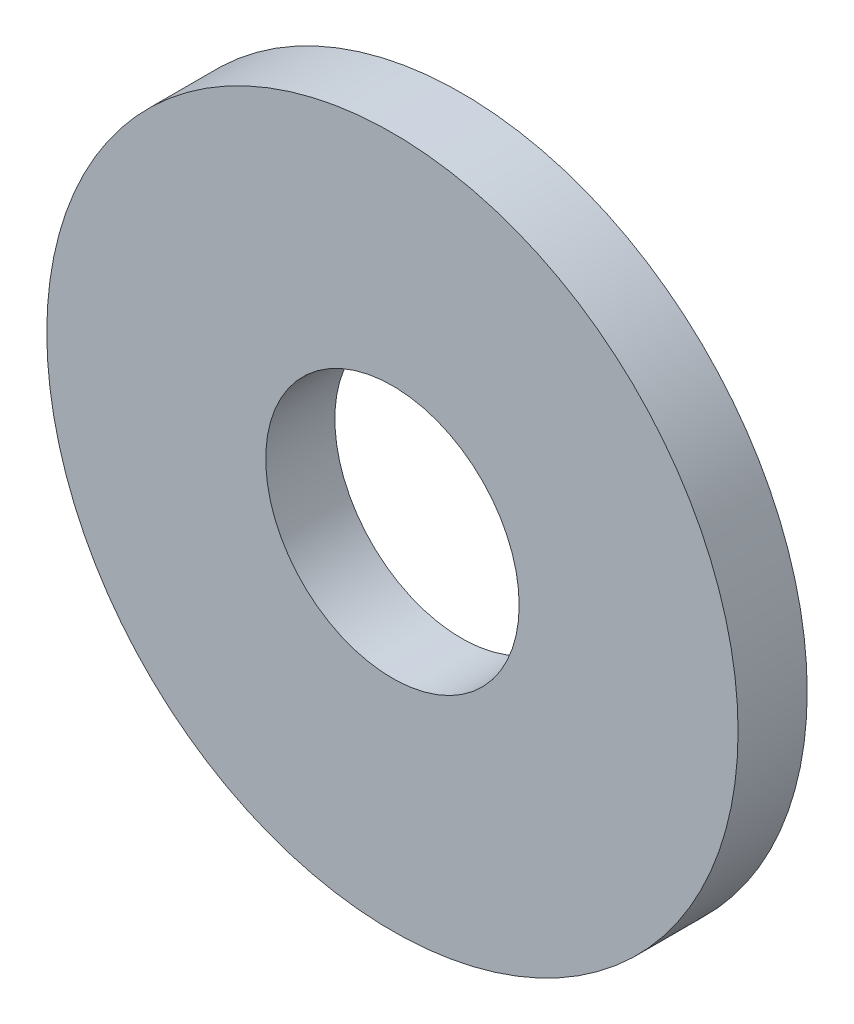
ISO-10303-21;
HEADER;
FILE_DESCRIPTION(('STEP AP214'),'2;1');
FILE_NAME('part.step','',(''),(''),'','','');
FILE_SCHEMA(('AUTOMOTIVE_DESIGN { 1 0 10303 214 1 1 1 1 }'));
ENDSEC;
DATA;
#1=APPLICATION_CONTEXT('core data for automotive mechanical design processes');
#2=APPLICATION_PROTOCOL_DEFINITION('international standard','automotive_design',2000,#1);
#3=PRODUCT_CONTEXT('',#1,'mechanical');
#4=PRODUCT('Part','Part','',(#3));
#5=PRODUCT_RELATED_PRODUCT_CATEGORY('part','',(#4));
#6=PRODUCT_DEFINITION_FORMATION('','',#4);
#7=PRODUCT_DEFINITION_CONTEXT('part definition',#1,'design');
#8=PRODUCT_DEFINITION('design','',#6,#7);
#9=PRODUCT_DEFINITION_SHAPE('','',#8);
#10=(LENGTH_UNIT() NAMED_UNIT(*) SI_UNIT(.MILLI.,.METRE.));
#11=(NAMED_UNIT(*) PLANE_ANGLE_UNIT() SI_UNIT($,.RADIAN.));
#12=(NAMED_UNIT(*) SI_UNIT($,.STERADIAN.) SOLID_ANGLE_UNIT());
#13=UNCERTAINTY_MEASURE_WITH_UNIT(LENGTH_MEASURE(1.E-05),#10,'distance_accuracy_value','');
#14=(GEOMETRIC_REPRESENTATION_CONTEXT(3) GLOBAL_UNCERTAINTY_ASSIGNED_CONTEXT((#13)) GLOBAL_UNIT_ASSIGNED_CONTEXT((#10,
#11,#12)) REPRESENTATION_CONTEXT('',''));
#15=CARTESIAN_POINT('',(0.,0.,0.));
#16=DIRECTION('',(0.,0.,1.));
#17=DIRECTION('',(1.,0.,0.));
#18=AXIS2_PLACEMENT_3D('',#15,#16,#17);
#19=CARTESIAN_POINT('',(0.,0.,0.6));
#20=DIRECTION('',(0.,0.,1.));
#21=DIRECTION('',(1.,0.,0.));
#22=AXIS2_PLACEMENT_3D('',#19,#20,#21);
#23=PLANE('',#22);
#24=CARTESIAN_POINT('',(0.,0.,0.6));
#25=DIRECTION('',(0.,0.,1.));
#26=DIRECTION('',(1.,0.,0.));
#27=AXIS2_PLACEMENT_3D('',#24,#25,#26);
#28=CIRCLE('',#27,3.);
#29=CARTESIAN_POINT('',(3.,0.,0.6));
#30=VERTEX_POINT('',#29);
#31=EDGE_CURVE('E10',#30,#30,#28,.T.);
#32=ORIENTED_EDGE('',*,*,#31,.T.);
#33=EDGE_LOOP('',(#32));
#34=FACE_BOUND('',#33,.T.);
#35=CARTESIAN_POINT('',(0.,0.,0.6));
#36=DIRECTION('',(0.,0.,1.));
#37=DIRECTION('',(1.,0.,0.));
#38=AXIS2_PLACEMENT_3D('',#35,#36,#37);
#39=CIRCLE('',#38,1.1);
#40=CARTESIAN_POINT('',(1.1,0.,0.6));
#41=VERTEX_POINT('',#40);
#42=EDGE_CURVE('E38',#41,#41,#39,.T.);
#43=ORIENTED_EDGE('',*,*,#42,.F.);
#44=EDGE_LOOP('',(#43));
#45=FACE_BOUND('',#44,.T.);
#46=ADVANCED_FACE('F27',(#34,#45),#23,.T.);
#47=CARTESIAN_POINT('',(0.,0.,0.));
#48=DIRECTION('',(0.,0.,1.));
#49=DIRECTION('',(1.,0.,0.));
#50=AXIS2_PLACEMENT_3D('',#47,#48,#49);
#51=PLANE('',#50);
#52=CARTESIAN_POINT('',(0.,0.,0.));
#53=DIRECTION('',(0.,0.,1.));
#54=DIRECTION('',(1.,0.,0.));
#55=AXIS2_PLACEMENT_3D('',#52,#53,#54);
#56=CIRCLE('',#55,3.);
#57=CARTESIAN_POINT('',(3.,0.,0.));
#58=VERTEX_POINT('',#57);
#59=EDGE_CURVE('E34',#58,#58,#56,.T.);
#60=ORIENTED_EDGE('',*,*,#59,.F.);
#61=EDGE_LOOP('',(#60));
#62=FACE_BOUND('',#61,.T.);
#63=CARTESIAN_POINT('',(0.,0.,0.));
#64=DIRECTION('',(0.,0.,1.));
#65=DIRECTION('',(1.,0.,0.));
#66=AXIS2_PLACEMENT_3D('',#63,#64,#65);
#67=CIRCLE('',#66,1.1);
#68=CARTESIAN_POINT('',(1.1,0.,0.));
#69=VERTEX_POINT('',#68);
#70=EDGE_CURVE('E42',#69,#69,#67,.T.);
#71=ORIENTED_EDGE('',*,*,#70,.T.);
#72=EDGE_LOOP('',(#71));
#73=FACE_BOUND('',#72,.T.);
#74=ADVANCED_FACE('F48',(#62,#73),#51,.F.);
#75=CARTESIAN_POINT('',(0.,0.,0.6));
#76=DIRECTION('',(0.,0.,-1.));
#77=DIRECTION('',(-1.,0.,0.));
#78=AXIS2_PLACEMENT_3D('',#75,#76,#77);
#79=CYLINDRICAL_SURFACE('',#78,3.);
#80=ORIENTED_EDGE('',*,*,#31,.F.);
#81=EDGE_LOOP('',(#80));
#82=FACE_BOUND('',#81,.T.);
#83=ORIENTED_EDGE('',*,*,#59,.T.);
#84=EDGE_LOOP('',(#83));
#85=FACE_BOUND('',#84,.T.);
#86=ADVANCED_FACE('F29',(#82,#85),#79,.T.);
#87=CARTESIAN_POINT('',(0.,0.,0.6));
#88=DIRECTION('',(0.,0.,-1.));
#89=DIRECTION('',(-1.,0.,0.));
#90=AXIS2_PLACEMENT_3D('',#87,#88,#89);
#91=CYLINDRICAL_SURFACE('',#90,1.1);
#92=ORIENTED_EDGE('',*,*,#42,.T.);
#93=EDGE_LOOP('',(#92));
#94=FACE_BOUND('',#93,.T.);
#95=ORIENTED_EDGE('',*,*,#70,.F.);
#96=EDGE_LOOP('',(#95));
#97=FACE_BOUND('',#96,.T.);
#98=ADVANCED_FACE('F50',(#94,#97),#91,.F.);
#99=CLOSED_SHELL('',(#46,#74,#86,#98));
#100=MANIFOLD_SOLID_BREP('B2',#99);
#101=ADVANCED_BREP_SHAPE_REPRESENTATION('',(#18,#100),#14);
#102=SHAPE_DEFINITION_REPRESENTATION(#9,#101);
ENDSEC;
END-ISO-10303-21;
